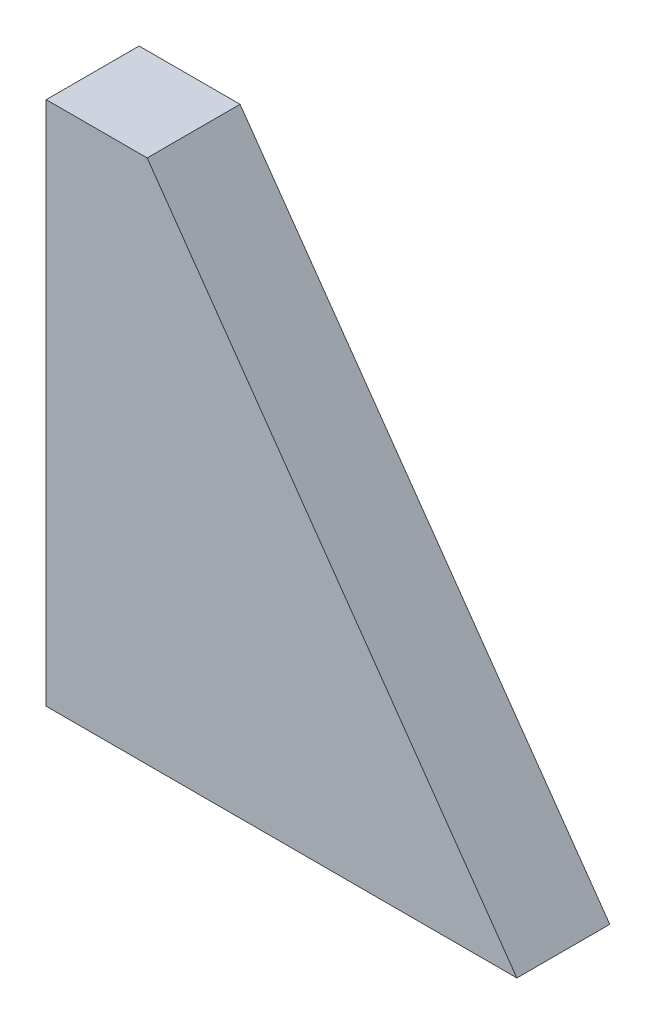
ISO-10303-21;
HEADER;
FILE_DESCRIPTION(('STEP AP214'),'2;1');
FILE_NAME('part.step','',(''),(''),'','','');
FILE_SCHEMA(('AUTOMOTIVE_DESIGN { 1 0 10303 214 1 1 1 1 }'));
ENDSEC;
DATA;
#1=APPLICATION_CONTEXT('core data for automotive mechanical design processes');
#2=APPLICATION_PROTOCOL_DEFINITION('international standard','automotive_design',2000,#1);
#3=PRODUCT_CONTEXT('',#1,'mechanical');
#4=PRODUCT('Part','Part','',(#3));
#5=PRODUCT_RELATED_PRODUCT_CATEGORY('part','',(#4));
#6=PRODUCT_DEFINITION_FORMATION('','',#4);
#7=PRODUCT_DEFINITION_CONTEXT('part definition',#1,'design');
#8=PRODUCT_DEFINITION('design','',#6,#7);
#9=PRODUCT_DEFINITION_SHAPE('','',#8);
#10=(LENGTH_UNIT() NAMED_UNIT(*) SI_UNIT(.MILLI.,.METRE.));
#11=(NAMED_UNIT(*) PLANE_ANGLE_UNIT() SI_UNIT($,.RADIAN.));
#12=(NAMED_UNIT(*) SI_UNIT($,.STERADIAN.) SOLID_ANGLE_UNIT());
#13=UNCERTAINTY_MEASURE_WITH_UNIT(LENGTH_MEASURE(1.E-05),#10,'distance_accuracy_value','');
#14=(GEOMETRIC_REPRESENTATION_CONTEXT(3) GLOBAL_UNCERTAINTY_ASSIGNED_CONTEXT((#13)) GLOBAL_UNIT_ASSIGNED_CONTEXT((#10,
#11,#12)) REPRESENTATION_CONTEXT('',''));
#15=CARTESIAN_POINT('',(0.,0.,0.));
#16=DIRECTION('',(0.,0.,1.));
#17=DIRECTION('',(1.,0.,0.));
#18=AXIS2_PLACEMENT_3D('',#15,#16,#17);
#19=CARTESIAN_POINT('',(50.6582087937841,0.,5.));
#20=DIRECTION('',(-0.817796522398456,-0.575507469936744,0.));
#21=DIRECTION('',(0.575507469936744,-0.817796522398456,0.));
#22=AXIS2_PLACEMENT_3D('',#19,#20,#21);
#23=PLANE('',#22);
#24=DIRECTION('',(-0.575507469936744,0.817796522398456,0.));
#25=VECTOR('',#24,1.);
#26=CARTESIAN_POINT('',(50.6582087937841,0.,-5.));
#27=LINE('',#26,#25);
#28=CARTESIAN_POINT('',(50.6582087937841,0.,-5.));
#29=VERTEX_POINT('',#28);
#30=CARTESIAN_POINT('',(10.8651174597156,56.5460109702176,-5.));
#31=VERTEX_POINT('',#30);
#32=EDGE_CURVE('E96',#29,#31,#27,.T.);
#33=ORIENTED_EDGE('',*,*,#32,.T.);
#34=DIRECTION('',(0.,0.,-1.));
#35=VECTOR('',#34,1.);
#36=CARTESIAN_POINT('',(10.8651174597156,56.5460109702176,5.));
#37=LINE('',#36,#35);
#38=CARTESIAN_POINT('',(10.8651174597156,56.5460109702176,5.));
#39=VERTEX_POINT('',#38);
#40=EDGE_CURVE('E11',#39,#31,#37,.T.);
#41=ORIENTED_EDGE('',*,*,#40,.F.);
#42=DIRECTION('',(-0.575507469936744,0.817796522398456,0.));
#43=VECTOR('',#42,1.);
#44=CARTESIAN_POINT('',(50.6582087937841,0.,5.));
#45=LINE('',#44,#43);
#46=CARTESIAN_POINT('',(50.6582087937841,0.,5.));
#47=VERTEX_POINT('',#46);
#48=EDGE_CURVE('E84',#47,#39,#45,.T.);
#49=ORIENTED_EDGE('',*,*,#48,.F.);
#50=DIRECTION('',(0.,0.,-1.));
#51=VECTOR('',#50,1.);
#52=CARTESIAN_POINT('',(50.6582087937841,0.,5.));
#53=LINE('',#52,#51);
#54=EDGE_CURVE('E92',#47,#29,#53,.T.);
#55=ORIENTED_EDGE('',*,*,#54,.T.);
#56=EDGE_LOOP('',(#33,#41,#49,#55));
#57=FACE_BOUND('',#56,.T.);
#58=ADVANCED_FACE('F33',(#57),#23,.F.);
#59=CARTESIAN_POINT('',(10.8651174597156,56.5460109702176,5.));
#60=DIRECTION('',(0.,-1.,0.));
#61=DIRECTION('',(0.,0.,-1.));
#62=AXIS2_PLACEMENT_3D('',#59,#60,#61);
#63=PLANE('',#62);
#64=DIRECTION('',(-1.,0.,0.));
#65=VECTOR('',#64,1.);
#66=CARTESIAN_POINT('',(10.8651174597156,56.5460109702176,-5.));
#67=LINE('',#66,#65);
#68=CARTESIAN_POINT('',(0.,56.5460109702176,-5.));
#69=VERTEX_POINT('',#68);
#70=EDGE_CURVE('E88',#31,#69,#67,.T.);
#71=ORIENTED_EDGE('',*,*,#70,.T.);
#72=DIRECTION('',(0.,0.,-1.));
#73=VECTOR('',#72,1.);
#74=CARTESIAN_POINT('',(0.,56.5460109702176,5.));
#75=LINE('',#74,#73);
#76=CARTESIAN_POINT('',(0.,56.5460109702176,5.));
#77=VERTEX_POINT('',#76);
#78=EDGE_CURVE('E41',#77,#69,#75,.T.);
#79=ORIENTED_EDGE('',*,*,#78,.F.);
#80=DIRECTION('',(-1.,0.,0.));
#81=VECTOR('',#80,1.);
#82=CARTESIAN_POINT('',(10.8651174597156,56.5460109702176,5.));
#83=LINE('',#82,#81);
#84=EDGE_CURVE('E79',#39,#77,#83,.T.);
#85=ORIENTED_EDGE('',*,*,#84,.F.);
#86=ORIENTED_EDGE('',*,*,#40,.T.);
#87=EDGE_LOOP('',(#71,#79,#85,#86));
#88=FACE_BOUND('',#87,.T.);
#89=ADVANCED_FACE('F87',(#88),#63,.F.);
#90=CARTESIAN_POINT('',(0.,56.5460109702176,5.));
#91=DIRECTION('',(1.,0.,0.));
#92=DIRECTION('',(0.,0.,-1.));
#93=AXIS2_PLACEMENT_3D('',#90,#91,#92);
#94=PLANE('',#93);
#95=DIRECTION('',(0.,-1.,0.));
#96=VECTOR('',#95,1.);
#97=CARTESIAN_POINT('',(0.,56.5460109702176,-5.));
#98=LINE('',#97,#96);
#99=CARTESIAN_POINT('',(0.,0.,-5.));
#100=VERTEX_POINT('',#99);
#101=EDGE_CURVE('E66',#69,#100,#98,.T.);
#102=ORIENTED_EDGE('',*,*,#101,.T.);
#103=DIRECTION('',(0.,0.,-1.));
#104=VECTOR('',#103,1.);
#105=CARTESIAN_POINT('',(0.,0.,5.));
#106=LINE('',#105,#104);
#107=CARTESIAN_POINT('',(0.,0.,5.));
#108=VERTEX_POINT('',#107);
#109=EDGE_CURVE('E89',#108,#100,#106,.T.);
#110=ORIENTED_EDGE('',*,*,#109,.F.);
#111=DIRECTION('',(0.,-1.,0.));
#112=VECTOR('',#111,1.);
#113=CARTESIAN_POINT('',(0.,56.5460109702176,5.));
#114=LINE('',#113,#112);
#115=EDGE_CURVE('E82',#77,#108,#114,.T.);
#116=ORIENTED_EDGE('',*,*,#115,.F.);
#117=ORIENTED_EDGE('',*,*,#78,.T.);
#118=EDGE_LOOP('',(#102,#110,#116,#117));
#119=FACE_BOUND('',#118,.T.);
#120=ADVANCED_FACE('F90',(#119),#94,.F.);
#121=CARTESIAN_POINT('',(0.,0.,5.));
#122=DIRECTION('',(0.,1.,0.));
#123=DIRECTION('',(0.,0.,1.));
#124=AXIS2_PLACEMENT_3D('',#121,#122,#123);
#125=PLANE('',#124);
#126=DIRECTION('',(1.,0.,0.));
#127=VECTOR('',#126,1.);
#128=CARTESIAN_POINT('',(0.,0.,-5.));
#129=LINE('',#128,#127);
#130=EDGE_CURVE('E72',#100,#29,#129,.T.);
#131=ORIENTED_EDGE('',*,*,#130,.T.);
#132=ORIENTED_EDGE('',*,*,#54,.F.);
#133=DIRECTION('',(1.,0.,0.));
#134=VECTOR('',#133,1.);
#135=CARTESIAN_POINT('',(0.,0.,5.));
#136=LINE('',#135,#134);
#137=EDGE_CURVE('E49',#108,#47,#136,.T.);
#138=ORIENTED_EDGE('',*,*,#137,.F.);
#139=ORIENTED_EDGE('',*,*,#109,.T.);
#140=EDGE_LOOP('',(#131,#132,#138,#139));
#141=FACE_BOUND('',#140,.T.);
#142=ADVANCED_FACE('F103',(#141),#125,.F.);
#143=CARTESIAN_POINT('',(10.8651174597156,56.5460109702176,5.));
#144=DIRECTION('',(0.,0.,1.));
#145=DIRECTION('',(1.,0.,0.));
#146=AXIS2_PLACEMENT_3D('',#143,#144,#145);
#147=PLANE('',#146);
#148=ORIENTED_EDGE('',*,*,#48,.T.);
#149=ORIENTED_EDGE('',*,*,#84,.T.);
#150=ORIENTED_EDGE('',*,*,#115,.T.);
#151=ORIENTED_EDGE('',*,*,#137,.T.);
#152=EDGE_LOOP('',(#148,#149,#150,#151));
#153=FACE_BOUND('',#152,.T.);
#154=ADVANCED_FACE('F80',(#153),#147,.T.);
#155=CARTESIAN_POINT('',(10.8651174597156,56.5460109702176,-5.));
#156=DIRECTION('',(0.,0.,1.));
#157=DIRECTION('',(1.,0.,0.));
#158=AXIS2_PLACEMENT_3D('',#155,#156,#157);
#159=PLANE('',#158);
#160=ORIENTED_EDGE('',*,*,#32,.F.);
#161=ORIENTED_EDGE('',*,*,#130,.F.);
#162=ORIENTED_EDGE('',*,*,#101,.F.);
#163=ORIENTED_EDGE('',*,*,#70,.F.);
#164=EDGE_LOOP('',(#160,#161,#162,#163));
#165=FACE_BOUND('',#164,.T.);
#166=ADVANCED_FACE('F106',(#165),#159,.F.);
#167=CLOSED_SHELL('',(#58,#89,#120,#142,#154,#166));
#168=MANIFOLD_SOLID_BREP('B2',#167);
#169=ADVANCED_BREP_SHAPE_REPRESENTATION('',(#18,#168),#14);
#170=SHAPE_DEFINITION_REPRESENTATION(#9,#169);
ENDSEC;
END-ISO-10303-21;
